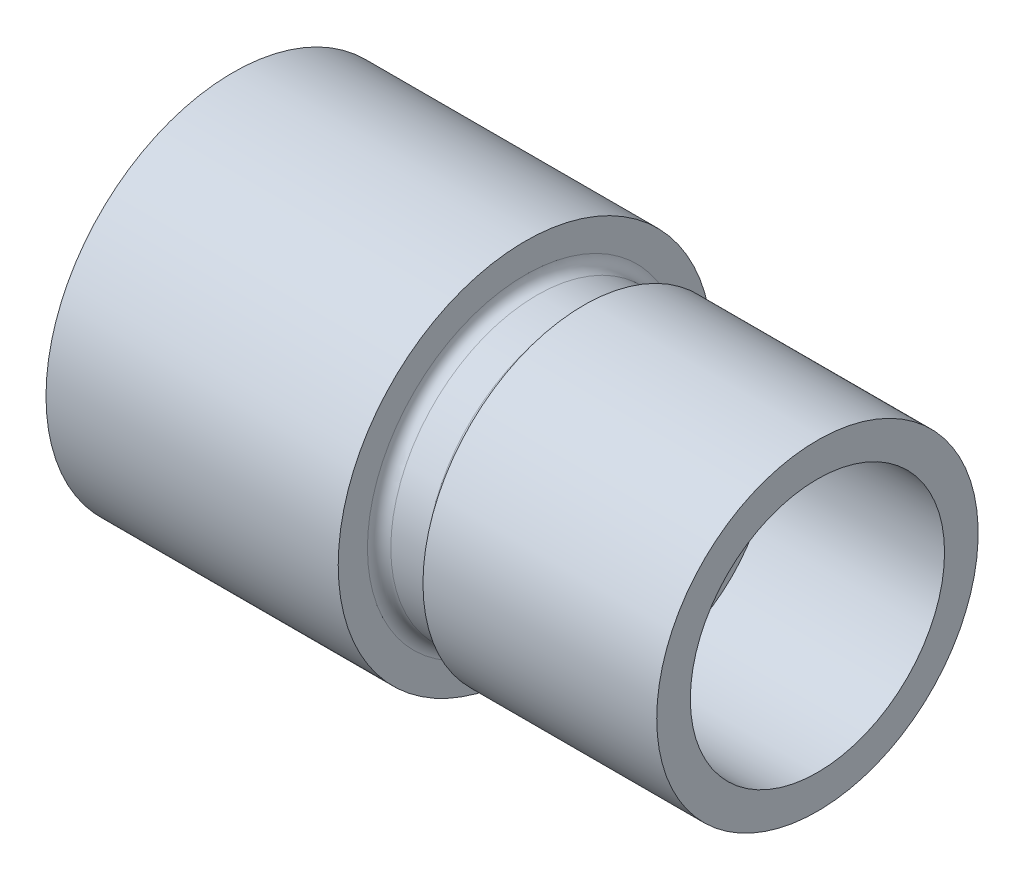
from build123d import *


with BuildPart() as part:
    # Esquisse1 → R_volution1 (revolve)
    with BuildSketch(Plane.XY, mode=Mode.PRIVATE) as r_volution1_sk:
        with BuildLine():
            Line((0, 6.4), (0, 4.325))
            Line((0, 4.325), (12, 4.325))
            Line((12, 4.325), (12, 2.65))
            Line((12, 2.65), (14, 2.65))
            Line((14, 2.65), (14, 4.35))
            Line((14, 4.35), (20, 4.35))
            Line((20, 4.35), (20, 5.5))
            Line((20, 5.5), (12, 5.5))
            Line((12, 5.5), (12, 5.4))
            ThreePointArc((12, 5.4), (11.882842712, 5.117157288), (11.6, 5))
            Line((11.6, 5), (10.4, 5))
            ThreePointArc((10.4, 5), (10.117157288, 5.117157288), (10, 5.4))
            Line((10, 5.4), (10, 6.4))
            Line((10, 6.4), (0, 6.4))
        make_face()
    revolve(r_volution1_sk.sketch.rotate(Axis((0, 0, 0), (1, 0, 0)), 90), axis=Axis((0, 0, 0), (1, 0, 0)))


solid = part.part
